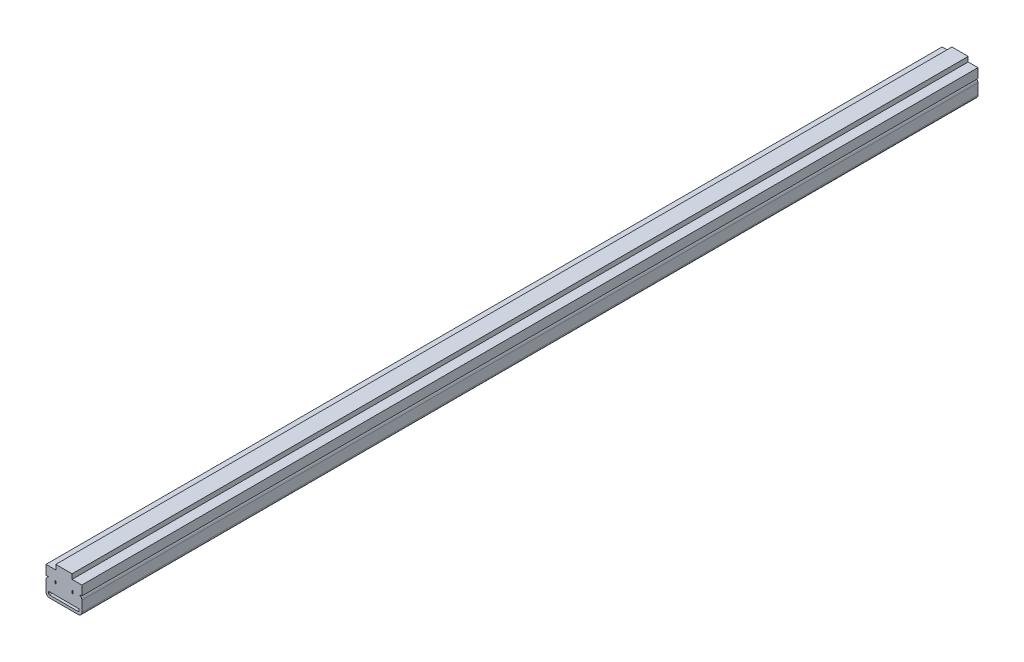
ISO-10303-21;
HEADER;
FILE_DESCRIPTION(('STEP AP214'),'2;1');
FILE_NAME('part.step','',(''),(''),'','','');
FILE_SCHEMA(('AUTOMOTIVE_DESIGN { 1 0 10303 214 1 1 1 1 }'));
ENDSEC;
DATA;
#1=APPLICATION_CONTEXT('core data for automotive mechanical design processes');
#2=APPLICATION_PROTOCOL_DEFINITION('international standard','automotive_design',2000,#1);
#3=PRODUCT_CONTEXT('',#1,'mechanical');
#4=PRODUCT('Part','Part','',(#3));
#5=PRODUCT_RELATED_PRODUCT_CATEGORY('part','',(#4));
#6=PRODUCT_DEFINITION_FORMATION('','',#4);
#7=PRODUCT_DEFINITION_CONTEXT('part definition',#1,'design');
#8=PRODUCT_DEFINITION('design','',#6,#7);
#9=PRODUCT_DEFINITION_SHAPE('','',#8);
#10=(LENGTH_UNIT() NAMED_UNIT(*) SI_UNIT(.MILLI.,.METRE.));
#11=(NAMED_UNIT(*) PLANE_ANGLE_UNIT() SI_UNIT($,.RADIAN.));
#12=(NAMED_UNIT(*) SI_UNIT($,.STERADIAN.) SOLID_ANGLE_UNIT());
#13=UNCERTAINTY_MEASURE_WITH_UNIT(LENGTH_MEASURE(1.E-05),#10,'distance_accuracy_value','');
#14=(GEOMETRIC_REPRESENTATION_CONTEXT(3) GLOBAL_UNCERTAINTY_ASSIGNED_CONTEXT((#13)) GLOBAL_UNIT_ASSIGNED_CONTEXT((#10,
#11,#12)) REPRESENTATION_CONTEXT('',''));
#15=CARTESIAN_POINT('',(0.,0.,0.));
#16=DIRECTION('',(0.,0.,1.));
#17=DIRECTION('',(1.,0.,0.));
#18=AXIS2_PLACEMENT_3D('',#15,#16,#17);
#19=CARTESIAN_POINT('',(8.,7.9999999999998,0.));
#20=DIRECTION('',(0.,0.,1.));
#21=DIRECTION('',(1.,0.,0.));
#22=AXIS2_PLACEMENT_3D('',#19,#20,#21);
#23=PLANE('',#22);
#24=DIRECTION('',(0.,-1.,0.));
#25=VECTOR('',#24,1.);
#26=CARTESIAN_POINT('',(-8.5,3.,0.));
#27=LINE('',#26,#25);
#28=CARTESIAN_POINT('',(-8.5,3.,0.));
#29=VERTEX_POINT('',#28);
#30=CARTESIAN_POINT('',(-8.5,2.,0.));
#31=VERTEX_POINT('',#30);
#32=EDGE_CURVE('E225',#29,#31,#27,.T.);
#33=ORIENTED_EDGE('',*,*,#32,.T.);
#34=CARTESIAN_POINT('',(-8.,2.,0.));
#35=DIRECTION('',(0.,0.,1.));
#36=DIRECTION('',(1.,0.,0.));
#37=AXIS2_PLACEMENT_3D('',#34,#35,#36);
#38=CIRCLE('',#37,0.5);
#39=CARTESIAN_POINT('',(-8.,1.5,0.));
#40=VERTEX_POINT('',#39);
#41=EDGE_CURVE('E220',#31,#40,#38,.T.);
#42=ORIENTED_EDGE('',*,*,#41,.T.);
#43=DIRECTION('',(-1.,0.,0.));
#44=VECTOR('',#43,1.);
#45=CARTESIAN_POINT('',(8.,1.5,0.));
#46=LINE('',#45,#44);
#47=CARTESIAN_POINT('',(8.,1.5,0.));
#48=VERTEX_POINT('',#47);
#49=EDGE_CURVE('E212',#48,#40,#46,.T.);
#50=ORIENTED_EDGE('',*,*,#49,.F.);
#51=CARTESIAN_POINT('',(8.,2.,0.));
#52=DIRECTION('',(0.,0.,1.));
#53=DIRECTION('',(1.,0.,0.));
#54=AXIS2_PLACEMENT_3D('',#51,#52,#53);
#55=CIRCLE('',#54,0.5);
#56=CARTESIAN_POINT('',(8.5,2.,0.));
#57=VERTEX_POINT('',#56);
#58=EDGE_CURVE('E29',#48,#57,#55,.T.);
#59=ORIENTED_EDGE('',*,*,#58,.T.);
#60=DIRECTION('',(0.,-1.,0.));
#61=VECTOR('',#60,1.);
#62=CARTESIAN_POINT('',(8.5,3.,0.));
#63=LINE('',#62,#61);
#64=CARTESIAN_POINT('',(8.5,3.,0.));
#65=VERTEX_POINT('',#64);
#66=EDGE_CURVE('E237',#65,#57,#63,.T.);
#67=ORIENTED_EDGE('',*,*,#66,.F.);
#68=DIRECTION('',(-1.,0.,0.));
#69=VECTOR('',#68,1.);
#70=CARTESIAN_POINT('',(8.5,3.,0.));
#71=LINE('',#70,#69);
#72=EDGE_CURVE('E239',#65,#29,#71,.T.);
#73=ORIENTED_EDGE('',*,*,#72,.T.);
#74=EDGE_LOOP('',(#33,#42,#50,#59,#67,#73));
#75=FACE_BOUND('',#74,.T.);
#76=DIRECTION('',(0.,-1.,0.));
#77=VECTOR('',#76,1.);
#78=CARTESIAN_POINT('',(4.55,18.,0.));
#79=LINE('',#78,#77);
#80=CARTESIAN_POINT('',(4.55,18.,0.));
#81=VERTEX_POINT('',#80);
#82=CARTESIAN_POINT('',(4.55,15.3,0.));
#83=VERTEX_POINT('',#82);
#84=EDGE_CURVE('E326',#81,#83,#79,.T.);
#85=ORIENTED_EDGE('',*,*,#84,.T.);
#86=DIRECTION('',(1.,0.,0.));
#87=VECTOR('',#86,1.);
#88=CARTESIAN_POINT('',(4.55,15.3,0.));
#89=LINE('',#88,#87);
#90=CARTESIAN_POINT('',(10.,15.3,0.));
#91=VERTEX_POINT('',#90);
#92=EDGE_CURVE('E329',#83,#91,#89,.T.);
#93=ORIENTED_EDGE('',*,*,#92,.T.);
#94=DIRECTION('',(0.,-1.,0.));
#95=VECTOR('',#94,1.);
#96=CARTESIAN_POINT('',(10.,15.3,0.));
#97=LINE('',#96,#95);
#98=CARTESIAN_POINT('',(10.,9.9999999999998,0.));
#99=VERTEX_POINT('',#98);
#100=EDGE_CURVE('E332',#91,#99,#97,.T.);
#101=ORIENTED_EDGE('',*,*,#100,.T.);
#102=DIRECTION('',(-1.,0.,0.));
#103=VECTOR('',#102,1.);
#104=CARTESIAN_POINT('',(10.,9.9999999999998,0.));
#105=LINE('',#104,#103);
#106=CARTESIAN_POINT('',(8.,9.9999999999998,0.));
#107=VERTEX_POINT('',#106);
#108=EDGE_CURVE('E334',#99,#107,#105,.T.);
#109=ORIENTED_EDGE('',*,*,#108,.T.);
#110=CARTESIAN_POINT('',(8.,7.9999999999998,0.));
#111=DIRECTION('',(0.,0.,1.));
#112=DIRECTION('',(1.,0.,0.));
#113=AXIS2_PLACEMENT_3D('',#110,#111,#112);
#114=CIRCLE('',#113,2.);
#115=CARTESIAN_POINT('',(10.,7.9999999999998,0.));
#116=VERTEX_POINT('',#115);
#117=EDGE_CURVE('E336',#116,#107,#114,.T.);
#118=ORIENTED_EDGE('',*,*,#117,.F.);
#119=DIRECTION('',(0.,-1.,0.));
#120=VECTOR('',#119,1.);
#121=CARTESIAN_POINT('',(10.,7.9999999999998,0.));
#122=LINE('',#121,#120);
#123=CARTESIAN_POINT('',(10.,2.,0.));
#124=VERTEX_POINT('',#123);
#125=EDGE_CURVE('E339',#116,#124,#122,.T.);
#126=ORIENTED_EDGE('',*,*,#125,.T.);
#127=CARTESIAN_POINT('',(8.,2.,0.));
#128=DIRECTION('',(0.,0.,1.));
#129=DIRECTION('',(1.,0.,0.));
#130=AXIS2_PLACEMENT_3D('',#127,#128,#129);
#131=CIRCLE('',#130,2.);
#132=CARTESIAN_POINT('',(8.,0.,0.));
#133=VERTEX_POINT('',#132);
#134=EDGE_CURVE('E341',#133,#124,#131,.T.);
#135=ORIENTED_EDGE('',*,*,#134,.F.);
#136=DIRECTION('',(-1.,0.,0.));
#137=VECTOR('',#136,1.);
#138=CARTESIAN_POINT('',(8.,0.,0.));
#139=LINE('',#138,#137);
#140=CARTESIAN_POINT('',(-8.,0.,0.));
#141=VERTEX_POINT('',#140);
#142=EDGE_CURVE('E344',#133,#141,#139,.T.);
#143=ORIENTED_EDGE('',*,*,#142,.T.);
#144=CARTESIAN_POINT('',(-8.,2.,0.));
#145=DIRECTION('',(0.,0.,1.));
#146=DIRECTION('',(1.,0.,0.));
#147=AXIS2_PLACEMENT_3D('',#144,#145,#146);
#148=CIRCLE('',#147,1.99999999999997);
#149=CARTESIAN_POINT('',(-10.,1.99999999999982,0.));
#150=VERTEX_POINT('',#149);
#151=EDGE_CURVE('E346',#150,#141,#148,.T.);
#152=ORIENTED_EDGE('',*,*,#151,.F.);
#153=DIRECTION('',(0.,-1.,0.));
#154=VECTOR('',#153,1.);
#155=CARTESIAN_POINT('',(-10.,7.9999999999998,0.));
#156=LINE('',#155,#154);
#157=CARTESIAN_POINT('',(-10.,7.9999999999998,0.));
#158=VERTEX_POINT('',#157);
#159=EDGE_CURVE('E349',#158,#150,#156,.T.);
#160=ORIENTED_EDGE('',*,*,#159,.F.);
#161=CARTESIAN_POINT('',(-8.,7.9999999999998,0.));
#162=DIRECTION('',(0.,0.,1.));
#163=DIRECTION('',(1.,0.,0.));
#164=AXIS2_PLACEMENT_3D('',#161,#162,#163);
#165=CIRCLE('',#164,1.99999999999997);
#166=CARTESIAN_POINT('',(-8.,9.9999999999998,0.));
#167=VERTEX_POINT('',#166);
#168=EDGE_CURVE('E352',#167,#158,#165,.T.);
#169=ORIENTED_EDGE('',*,*,#168,.F.);
#170=DIRECTION('',(-1.,0.,0.));
#171=VECTOR('',#170,1.);
#172=CARTESIAN_POINT('',(-8.,9.9999999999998,0.));
#173=LINE('',#172,#171);
#174=CARTESIAN_POINT('',(-10.,9.9999999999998,0.));
#175=VERTEX_POINT('',#174);
#176=EDGE_CURVE('E355',#167,#175,#173,.T.);
#177=ORIENTED_EDGE('',*,*,#176,.T.);
#178=DIRECTION('',(0.,-1.,0.));
#179=VECTOR('',#178,1.);
#180=CARTESIAN_POINT('',(-10.,15.3,0.));
#181=LINE('',#180,#179);
#182=CARTESIAN_POINT('',(-10.,15.3,0.));
#183=VERTEX_POINT('',#182);
#184=EDGE_CURVE('E357',#183,#175,#181,.T.);
#185=ORIENTED_EDGE('',*,*,#184,.F.);
#186=DIRECTION('',(-1.,0.,0.));
#187=VECTOR('',#186,1.);
#188=CARTESIAN_POINT('',(-4.55,15.3,0.));
#189=LINE('',#188,#187);
#190=CARTESIAN_POINT('',(-4.55,15.3,0.));
#191=VERTEX_POINT('',#190);
#192=EDGE_CURVE('E360',#191,#183,#189,.T.);
#193=ORIENTED_EDGE('',*,*,#192,.F.);
#194=DIRECTION('',(0.,-1.,0.));
#195=VECTOR('',#194,1.);
#196=CARTESIAN_POINT('',(-4.55,18.,0.));
#197=LINE('',#196,#195);
#198=CARTESIAN_POINT('',(-4.55,18.,0.));
#199=VERTEX_POINT('',#198);
#200=EDGE_CURVE('E363',#199,#191,#197,.T.);
#201=ORIENTED_EDGE('',*,*,#200,.F.);
#202=DIRECTION('',(-1.,0.,0.));
#203=VECTOR('',#202,1.);
#204=CARTESIAN_POINT('',(4.55,18.,0.));
#205=LINE('',#204,#203);
#206=EDGE_CURVE('E366',#81,#199,#205,.T.);
#207=ORIENTED_EDGE('',*,*,#206,.F.);
#208=EDGE_LOOP('',(#85,#93,#101,#109,#118,#126,#135,#143,#152,#160,#169,#177,#185,#193,#201,#207));
#209=FACE_BOUND('',#208,.T.);
#210=DIRECTION('',(-1.,1.11022302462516E-13,0.));
#211=VECTOR('',#210,1.);
#212=CARTESIAN_POINT('',(-4.5,8.4999999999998,0.));
#213=LINE('',#212,#211);
#214=CARTESIAN_POINT('',(-4.5,8.4999999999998,0.));
#215=VERTEX_POINT('',#214);
#216=CARTESIAN_POINT('',(-5.,8.5,0.));
#217=VERTEX_POINT('',#216);
#218=EDGE_CURVE('E305',#215,#217,#213,.T.);
#219=ORIENTED_EDGE('',*,*,#218,.F.);
#220=DIRECTION('',(0.,1.,0.));
#221=VECTOR('',#220,1.);
#222=CARTESIAN_POINT('',(-4.5,8.4999999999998,0.));
#223=LINE('',#222,#221);
#224=CARTESIAN_POINT('',(-4.5,10.,0.));
#225=VERTEX_POINT('',#224);
#226=EDGE_CURVE('E295',#215,#225,#223,.T.);
#227=ORIENTED_EDGE('',*,*,#226,.T.);
#228=DIRECTION('',(-1.,-1.11022302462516E-13,0.));
#229=VECTOR('',#228,1.);
#230=CARTESIAN_POINT('',(-4.5,10.,0.));
#231=LINE('',#230,#229);
#232=CARTESIAN_POINT('',(-5.,9.9999999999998,0.));
#233=VERTEX_POINT('',#232);
#234=EDGE_CURVE('E298',#225,#233,#231,.T.);
#235=ORIENTED_EDGE('',*,*,#234,.T.);
#236=DIRECTION('',(0.,1.,0.));
#237=VECTOR('',#236,1.);
#238=CARTESIAN_POINT('',(-5.,8.5,0.));
#239=LINE('',#238,#237);
#240=EDGE_CURVE('E302',#217,#233,#239,.T.);
#241=ORIENTED_EDGE('',*,*,#240,.F.);
#242=EDGE_LOOP('',(#219,#227,#235,#241));
#243=FACE_BOUND('',#242,.T.);
#244=DIRECTION('',(-1.,0.,0.));
#245=VECTOR('',#244,1.);
#246=CARTESIAN_POINT('',(5.,8.5,0.));
#247=LINE('',#246,#245);
#248=CARTESIAN_POINT('',(5.,8.5,0.));
#249=VERTEX_POINT('',#248);
#250=CARTESIAN_POINT('',(4.5,8.5,0.));
#251=VERTEX_POINT('',#250);
#252=EDGE_CURVE('E263',#249,#251,#247,.T.);
#253=ORIENTED_EDGE('',*,*,#252,.F.);
#254=DIRECTION('',(0.,1.,0.));
#255=VECTOR('',#254,1.);
#256=CARTESIAN_POINT('',(5.,8.5,0.));
#257=LINE('',#256,#255);
#258=CARTESIAN_POINT('',(5.,9.9999999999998,0.));
#259=VERTEX_POINT('',#258);
#260=EDGE_CURVE('E271',#249,#259,#257,.T.);
#261=ORIENTED_EDGE('',*,*,#260,.T.);
#262=DIRECTION('',(-1.,1.11022302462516E-13,0.));
#263=VECTOR('',#262,1.);
#264=CARTESIAN_POINT('',(5.,9.9999999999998,0.));
#265=LINE('',#264,#263);
#266=CARTESIAN_POINT('',(4.5,10.,0.));
#267=VERTEX_POINT('',#266);
#268=EDGE_CURVE('E268',#259,#267,#265,.T.);
#269=ORIENTED_EDGE('',*,*,#268,.T.);
#270=DIRECTION('',(0.,1.,0.));
#271=VECTOR('',#270,1.);
#272=CARTESIAN_POINT('',(4.5,8.5,0.));
#273=LINE('',#272,#271);
#274=EDGE_CURVE('E265',#251,#267,#273,.T.);
#275=ORIENTED_EDGE('',*,*,#274,.F.);
#276=EDGE_LOOP('',(#253,#261,#269,#275));
#277=FACE_BOUND('',#276,.T.);
#278=ADVANCED_FACE('F14',(#75,#209,#243,#277),#23,.F.);
#279=CARTESIAN_POINT('',(8.,7.9999999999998,500.));
#280=DIRECTION('',(0.,0.,1.));
#281=DIRECTION('',(1.,0.,0.));
#282=AXIS2_PLACEMENT_3D('',#279,#280,#281);
#283=PLANE('',#282);
#284=CARTESIAN_POINT('',(-8.,2.,500.));
#285=DIRECTION('',(0.,0.,1.));
#286=DIRECTION('',(1.,0.,0.));
#287=AXIS2_PLACEMENT_3D('',#284,#285,#286);
#288=CIRCLE('',#287,0.5);
#289=CARTESIAN_POINT('',(-8.5,2.,500.));
#290=VERTEX_POINT('',#289);
#291=CARTESIAN_POINT('',(-8.,1.5,500.));
#292=VERTEX_POINT('',#291);
#293=EDGE_CURVE('E37',#290,#292,#288,.T.);
#294=ORIENTED_EDGE('',*,*,#293,.F.);
#295=DIRECTION('',(0.,-1.,0.));
#296=VECTOR('',#295,1.);
#297=CARTESIAN_POINT('',(-8.5,3.,500.));
#298=LINE('',#297,#296);
#299=CARTESIAN_POINT('',(-8.5,3.,500.));
#300=VERTEX_POINT('',#299);
#301=EDGE_CURVE('E230',#300,#290,#298,.T.);
#302=ORIENTED_EDGE('',*,*,#301,.F.);
#303=DIRECTION('',(-1.,0.,0.));
#304=VECTOR('',#303,1.);
#305=CARTESIAN_POINT('',(8.5,3.,500.));
#306=LINE('',#305,#304);
#307=CARTESIAN_POINT('',(8.5,3.,500.));
#308=VERTEX_POINT('',#307);
#309=EDGE_CURVE('E233',#308,#300,#306,.T.);
#310=ORIENTED_EDGE('',*,*,#309,.F.);
#311=DIRECTION('',(0.,-1.,0.));
#312=VECTOR('',#311,1.);
#313=CARTESIAN_POINT('',(8.5,3.,500.));
#314=LINE('',#313,#312);
#315=CARTESIAN_POINT('',(8.5,2.,500.));
#316=VERTEX_POINT('',#315);
#317=EDGE_CURVE('E248',#308,#316,#314,.T.);
#318=ORIENTED_EDGE('',*,*,#317,.T.);
#319=CARTESIAN_POINT('',(8.,2.,500.));
#320=DIRECTION('',(0.,0.,1.));
#321=DIRECTION('',(1.,0.,0.));
#322=AXIS2_PLACEMENT_3D('',#319,#320,#321);
#323=CIRCLE('',#322,0.5);
#324=CARTESIAN_POINT('',(8.,1.5,500.));
#325=VERTEX_POINT('',#324);
#326=EDGE_CURVE('E245',#325,#316,#323,.T.);
#327=ORIENTED_EDGE('',*,*,#326,.F.);
#328=DIRECTION('',(-1.,0.,0.));
#329=VECTOR('',#328,1.);
#330=CARTESIAN_POINT('',(8.,1.5,500.));
#331=LINE('',#330,#329);
#332=EDGE_CURVE('E243',#325,#292,#331,.T.);
#333=ORIENTED_EDGE('',*,*,#332,.T.);
#334=EDGE_LOOP('',(#294,#302,#310,#318,#327,#333));
#335=FACE_BOUND('',#334,.T.);
#336=DIRECTION('',(0.,-1.,0.));
#337=VECTOR('',#336,1.);
#338=CARTESIAN_POINT('',(4.55,18.,500.));
#339=LINE('',#338,#337);
#340=CARTESIAN_POINT('',(4.55,18.,500.));
#341=VERTEX_POINT('',#340);
#342=CARTESIAN_POINT('',(4.55,15.3,500.));
#343=VERTEX_POINT('',#342);
#344=EDGE_CURVE('E319',#341,#343,#339,.T.);
#345=ORIENTED_EDGE('',*,*,#344,.F.);
#346=DIRECTION('',(-1.,0.,0.));
#347=VECTOR('',#346,1.);
#348=CARTESIAN_POINT('',(4.55,18.,500.));
#349=LINE('',#348,#347);
#350=CARTESIAN_POINT('',(-4.55,18.,500.));
#351=VERTEX_POINT('',#350);
#352=EDGE_CURVE('E330',#341,#351,#349,.T.);
#353=ORIENTED_EDGE('',*,*,#352,.T.);
#354=DIRECTION('',(0.,-1.,0.));
#355=VECTOR('',#354,1.);
#356=CARTESIAN_POINT('',(-4.55,18.,500.));
#357=LINE('',#356,#355);
#358=CARTESIAN_POINT('',(-4.55,15.3,500.));
#359=VERTEX_POINT('',#358);
#360=EDGE_CURVE('E409',#351,#359,#357,.T.);
#361=ORIENTED_EDGE('',*,*,#360,.T.);
#362=DIRECTION('',(-1.,0.,0.));
#363=VECTOR('',#362,1.);
#364=CARTESIAN_POINT('',(-4.55,15.3,500.));
#365=LINE('',#364,#363);
#366=CARTESIAN_POINT('',(-10.,15.3,500.));
#367=VERTEX_POINT('',#366);
#368=EDGE_CURVE('E406',#359,#367,#365,.T.);
#369=ORIENTED_EDGE('',*,*,#368,.T.);
#370=DIRECTION('',(0.,-1.,0.));
#371=VECTOR('',#370,1.);
#372=CARTESIAN_POINT('',(-10.,15.3,500.));
#373=LINE('',#372,#371);
#374=CARTESIAN_POINT('',(-10.,9.9999999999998,500.));
#375=VERTEX_POINT('',#374);
#376=EDGE_CURVE('E403',#367,#375,#373,.T.);
#377=ORIENTED_EDGE('',*,*,#376,.T.);
#378=DIRECTION('',(-1.,0.,0.));
#379=VECTOR('',#378,1.);
#380=CARTESIAN_POINT('',(-8.,9.9999999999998,500.));
#381=LINE('',#380,#379);
#382=CARTESIAN_POINT('',(-8.,9.9999999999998,500.));
#383=VERTEX_POINT('',#382);
#384=EDGE_CURVE('E400',#383,#375,#381,.T.);
#385=ORIENTED_EDGE('',*,*,#384,.F.);
#386=CARTESIAN_POINT('',(-8.,7.9999999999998,500.));
#387=DIRECTION('',(0.,0.,1.));
#388=DIRECTION('',(1.,0.,0.));
#389=AXIS2_PLACEMENT_3D('',#386,#387,#388);
#390=CIRCLE('',#389,1.99999999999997);
#391=CARTESIAN_POINT('',(-10.,7.9999999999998,500.));
#392=VERTEX_POINT('',#391);
#393=EDGE_CURVE('E397',#383,#392,#390,.T.);
#394=ORIENTED_EDGE('',*,*,#393,.T.);
#395=DIRECTION('',(0.,-1.,0.));
#396=VECTOR('',#395,1.);
#397=CARTESIAN_POINT('',(-10.,7.9999999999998,500.));
#398=LINE('',#397,#396);
#399=CARTESIAN_POINT('',(-10.,1.99999999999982,500.));
#400=VERTEX_POINT('',#399);
#401=EDGE_CURVE('E394',#392,#400,#398,.T.);
#402=ORIENTED_EDGE('',*,*,#401,.T.);
#403=CARTESIAN_POINT('',(-8.,2.,500.));
#404=DIRECTION('',(0.,0.,1.));
#405=DIRECTION('',(1.,0.,0.));
#406=AXIS2_PLACEMENT_3D('',#403,#404,#405);
#407=CIRCLE('',#406,1.99999999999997);
#408=CARTESIAN_POINT('',(-8.,0.,500.));
#409=VERTEX_POINT('',#408);
#410=EDGE_CURVE('E391',#400,#409,#407,.T.);
#411=ORIENTED_EDGE('',*,*,#410,.T.);
#412=DIRECTION('',(-1.,0.,0.));
#413=VECTOR('',#412,1.);
#414=CARTESIAN_POINT('',(8.,0.,500.));
#415=LINE('',#414,#413);
#416=CARTESIAN_POINT('',(8.,0.,500.));
#417=VERTEX_POINT('',#416);
#418=EDGE_CURVE('E388',#417,#409,#415,.T.);
#419=ORIENTED_EDGE('',*,*,#418,.F.);
#420=CARTESIAN_POINT('',(8.,2.,500.));
#421=DIRECTION('',(0.,0.,1.));
#422=DIRECTION('',(1.,0.,0.));
#423=AXIS2_PLACEMENT_3D('',#420,#421,#422);
#424=CIRCLE('',#423,2.);
#425=CARTESIAN_POINT('',(10.,2.,500.));
#426=VERTEX_POINT('',#425);
#427=EDGE_CURVE('E385',#417,#426,#424,.T.);
#428=ORIENTED_EDGE('',*,*,#427,.T.);
#429=DIRECTION('',(0.,-1.,0.));
#430=VECTOR('',#429,1.);
#431=CARTESIAN_POINT('',(10.,7.9999999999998,500.));
#432=LINE('',#431,#430);
#433=CARTESIAN_POINT('',(10.,7.9999999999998,500.));
#434=VERTEX_POINT('',#433);
#435=EDGE_CURVE('E382',#434,#426,#432,.T.);
#436=ORIENTED_EDGE('',*,*,#435,.F.);
#437=CARTESIAN_POINT('',(8.,7.9999999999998,500.));
#438=DIRECTION('',(0.,0.,1.));
#439=DIRECTION('',(1.,0.,0.));
#440=AXIS2_PLACEMENT_3D('',#437,#438,#439);
#441=CIRCLE('',#440,2.);
#442=CARTESIAN_POINT('',(8.,9.9999999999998,500.));
#443=VERTEX_POINT('',#442);
#444=EDGE_CURVE('E379',#434,#443,#441,.T.);
#445=ORIENTED_EDGE('',*,*,#444,.T.);
#446=DIRECTION('',(-1.,0.,0.));
#447=VECTOR('',#446,1.);
#448=CARTESIAN_POINT('',(10.,9.9999999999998,500.));
#449=LINE('',#448,#447);
#450=CARTESIAN_POINT('',(10.,9.9999999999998,500.));
#451=VERTEX_POINT('',#450);
#452=EDGE_CURVE('E376',#451,#443,#449,.T.);
#453=ORIENTED_EDGE('',*,*,#452,.F.);
#454=DIRECTION('',(0.,-1.,0.));
#455=VECTOR('',#454,1.);
#456=CARTESIAN_POINT('',(10.,15.3,500.));
#457=LINE('',#456,#455);
#458=CARTESIAN_POINT('',(10.,15.3,500.));
#459=VERTEX_POINT('',#458);
#460=EDGE_CURVE('E374',#459,#451,#457,.T.);
#461=ORIENTED_EDGE('',*,*,#460,.F.);
#462=DIRECTION('',(1.,0.,0.));
#463=VECTOR('',#462,1.);
#464=CARTESIAN_POINT('',(4.55,15.3,500.));
#465=LINE('',#464,#463);
#466=EDGE_CURVE('E372',#343,#459,#465,.T.);
#467=ORIENTED_EDGE('',*,*,#466,.F.);
#468=EDGE_LOOP('',(#345,#353,#361,#369,#377,#385,#394,#402,#411,#419,#428,#436,#445,#453,#461,#467));
#469=FACE_BOUND('',#468,.T.);
#470=DIRECTION('',(0.,1.,0.));
#471=VECTOR('',#470,1.);
#472=CARTESIAN_POINT('',(-4.5,8.4999999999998,500.));
#473=LINE('',#472,#471);
#474=CARTESIAN_POINT('',(-4.5,8.4999999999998,500.));
#475=VERTEX_POINT('',#474);
#476=CARTESIAN_POINT('',(-4.5,10.,500.));
#477=VERTEX_POINT('',#476);
#478=EDGE_CURVE('E294',#475,#477,#473,.T.);
#479=ORIENTED_EDGE('',*,*,#478,.F.);
#480=DIRECTION('',(-1.,1.11022302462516E-13,0.));
#481=VECTOR('',#480,1.);
#482=CARTESIAN_POINT('',(-4.5,8.4999999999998,500.));
#483=LINE('',#482,#481);
#484=CARTESIAN_POINT('',(-5.,8.5,500.));
#485=VERTEX_POINT('',#484);
#486=EDGE_CURVE('E299',#475,#485,#483,.T.);
#487=ORIENTED_EDGE('',*,*,#486,.T.);
#488=DIRECTION('',(0.,1.,0.));
#489=VECTOR('',#488,1.);
#490=CARTESIAN_POINT('',(-5.,8.5,500.));
#491=LINE('',#490,#489);
#492=CARTESIAN_POINT('',(-5.,9.9999999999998,500.));
#493=VERTEX_POINT('',#492);
#494=EDGE_CURVE('E312',#485,#493,#491,.T.);
#495=ORIENTED_EDGE('',*,*,#494,.T.);
#496=DIRECTION('',(-1.,-1.11022302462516E-13,0.));
#497=VECTOR('',#496,1.);
#498=CARTESIAN_POINT('',(-4.5,10.,500.));
#499=LINE('',#498,#497);
#500=EDGE_CURVE('E309',#477,#493,#499,.T.);
#501=ORIENTED_EDGE('',*,*,#500,.F.);
#502=EDGE_LOOP('',(#479,#487,#495,#501));
#503=FACE_BOUND('',#502,.T.);
#504=DIRECTION('',(0.,1.,0.));
#505=VECTOR('',#504,1.);
#506=CARTESIAN_POINT('',(5.,8.5,500.));
#507=LINE('',#506,#505);
#508=CARTESIAN_POINT('',(5.,8.5,500.));
#509=VERTEX_POINT('',#508);
#510=CARTESIAN_POINT('',(5.,9.9999999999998,500.));
#511=VERTEX_POINT('',#510);
#512=EDGE_CURVE('E266',#509,#511,#507,.T.);
#513=ORIENTED_EDGE('',*,*,#512,.F.);
#514=DIRECTION('',(-1.,0.,0.));
#515=VECTOR('',#514,1.);
#516=CARTESIAN_POINT('',(5.,8.5,500.));
#517=LINE('',#516,#515);
#518=CARTESIAN_POINT('',(4.5,8.5,500.));
#519=VERTEX_POINT('',#518);
#520=EDGE_CURVE('E255',#509,#519,#517,.T.);
#521=ORIENTED_EDGE('',*,*,#520,.T.);
#522=DIRECTION('',(0.,1.,0.));
#523=VECTOR('',#522,1.);
#524=CARTESIAN_POINT('',(4.5,8.5,500.));
#525=LINE('',#524,#523);
#526=CARTESIAN_POINT('',(4.5,10.,500.));
#527=VERTEX_POINT('',#526);
#528=EDGE_CURVE('E277',#519,#527,#525,.T.);
#529=ORIENTED_EDGE('',*,*,#528,.T.);
#530=DIRECTION('',(-1.,1.11022302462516E-13,0.));
#531=VECTOR('',#530,1.);
#532=CARTESIAN_POINT('',(5.,9.9999999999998,500.));
#533=LINE('',#532,#531);
#534=EDGE_CURVE('E280',#511,#527,#533,.T.);
#535=ORIENTED_EDGE('',*,*,#534,.F.);
#536=EDGE_LOOP('',(#513,#521,#529,#535));
#537=FACE_BOUND('',#536,.T.);
#538=ADVANCED_FACE('F452',(#335,#469,#503,#537),#283,.T.);
#539=CARTESIAN_POINT('',(4.55,18.,0.));
#540=DIRECTION('',(-1.,0.,0.));
#541=DIRECTION('',(0.,0.,1.));
#542=AXIS2_PLACEMENT_3D('',#539,#540,#541);
#543=PLANE('',#542);
#544=ORIENTED_EDGE('',*,*,#344,.T.);
#545=DIRECTION('',(0.,0.,1.));
#546=VECTOR('',#545,1.);
#547=CARTESIAN_POINT('',(4.55,15.3,0.));
#548=LINE('',#547,#546);
#549=EDGE_CURVE('E9',#83,#343,#548,.T.);
#550=ORIENTED_EDGE('',*,*,#549,.F.);
#551=ORIENTED_EDGE('',*,*,#84,.F.);
#552=DIRECTION('',(0.,0.,1.));
#553=VECTOR('',#552,1.);
#554=CARTESIAN_POINT('',(4.55,18.,0.));
#555=LINE('',#554,#553);
#556=EDGE_CURVE('E369',#81,#341,#555,.T.);
#557=ORIENTED_EDGE('',*,*,#556,.T.);
#558=EDGE_LOOP('',(#544,#550,#551,#557));
#559=FACE_BOUND('',#558,.T.);
#560=ADVANCED_FACE('F16',(#559),#543,.F.);
#561=CARTESIAN_POINT('',(4.55,15.3,0.));
#562=DIRECTION('',(0.,-1.,0.));
#563=DIRECTION('',(0.,0.,-1.));
#564=AXIS2_PLACEMENT_3D('',#561,#562,#563);
#565=PLANE('',#564);
#566=ORIENTED_EDGE('',*,*,#466,.T.);
#567=DIRECTION('',(0.,0.,1.));
#568=VECTOR('',#567,1.);
#569=CARTESIAN_POINT('',(10.,15.3,0.));
#570=LINE('',#569,#568);
#571=EDGE_CURVE('E22',#91,#459,#570,.T.);
#572=ORIENTED_EDGE('',*,*,#571,.F.);
#573=ORIENTED_EDGE('',*,*,#92,.F.);
#574=ORIENTED_EDGE('',*,*,#549,.T.);
#575=EDGE_LOOP('',(#566,#572,#573,#574));
#576=FACE_BOUND('',#575,.T.);
#577=ADVANCED_FACE('F465',(#576),#565,.F.);
#578=CARTESIAN_POINT('',(10.,15.3,0.));
#579=DIRECTION('',(-1.,0.,0.));
#580=DIRECTION('',(0.,-1.,0.));
#581=AXIS2_PLACEMENT_3D('',#578,#579,#580);
#582=PLANE('',#581);
#583=ORIENTED_EDGE('',*,*,#460,.T.);
#584=DIRECTION('',(0.,0.,1.));
#585=VECTOR('',#584,1.);
#586=CARTESIAN_POINT('',(10.,9.9999999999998,0.));
#587=LINE('',#586,#585);
#588=EDGE_CURVE('E439',#99,#451,#587,.T.);
#589=ORIENTED_EDGE('',*,*,#588,.F.);
#590=ORIENTED_EDGE('',*,*,#100,.F.);
#591=ORIENTED_EDGE('',*,*,#571,.T.);
#592=EDGE_LOOP('',(#583,#589,#590,#591));
#593=FACE_BOUND('',#592,.T.);
#594=ADVANCED_FACE('F446',(#593),#582,.F.);
#595=CARTESIAN_POINT('',(10.,9.9999999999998,0.));
#596=DIRECTION('',(0.,1.,0.));
#597=DIRECTION('',(0.,0.,1.));
#598=AXIS2_PLACEMENT_3D('',#595,#596,#597);
#599=PLANE('',#598);
#600=ORIENTED_EDGE('',*,*,#452,.T.);
#601=DIRECTION('',(0.,0.,1.));
#602=VECTOR('',#601,1.);
#603=CARTESIAN_POINT('',(8.,9.9999999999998,0.));
#604=LINE('',#603,#602);
#605=EDGE_CURVE('E437',#107,#443,#604,.T.);
#606=ORIENTED_EDGE('',*,*,#605,.F.);
#607=ORIENTED_EDGE('',*,*,#108,.F.);
#608=ORIENTED_EDGE('',*,*,#588,.T.);
#609=EDGE_LOOP('',(#600,#606,#607,#608));
#610=FACE_BOUND('',#609,.T.);
#611=ADVANCED_FACE('F458',(#610),#599,.F.);
#612=CARTESIAN_POINT('',(8.,7.9999999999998,0.));
#613=DIRECTION('',(0.,0.,1.));
#614=DIRECTION('',(1.,0.,0.));
#615=AXIS2_PLACEMENT_3D('',#612,#613,#614);
#616=CYLINDRICAL_SURFACE('',#615,2.);
#617=ORIENTED_EDGE('',*,*,#444,.F.);
#618=DIRECTION('',(0.,0.,1.));
#619=VECTOR('',#618,1.);
#620=CARTESIAN_POINT('',(10.,7.9999999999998,0.));
#621=LINE('',#620,#619);
#622=EDGE_CURVE('E435',#116,#434,#621,.T.);
#623=ORIENTED_EDGE('',*,*,#622,.F.);
#624=ORIENTED_EDGE('',*,*,#117,.T.);
#625=ORIENTED_EDGE('',*,*,#605,.T.);
#626=EDGE_LOOP('',(#617,#623,#624,#625));
#627=FACE_BOUND('',#626,.T.);
#628=ADVANCED_FACE('F511',(#627),#616,.T.);
#629=CARTESIAN_POINT('',(10.,7.9999999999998,0.));
#630=DIRECTION('',(-1.,0.,0.));
#631=DIRECTION('',(0.,0.,1.));
#632=AXIS2_PLACEMENT_3D('',#629,#630,#631);
#633=PLANE('',#632);
#634=ORIENTED_EDGE('',*,*,#435,.T.);
#635=DIRECTION('',(0.,0.,1.));
#636=VECTOR('',#635,1.);
#637=CARTESIAN_POINT('',(10.,2.,0.));
#638=LINE('',#637,#636);
#639=EDGE_CURVE('E433',#124,#426,#638,.T.);
#640=ORIENTED_EDGE('',*,*,#639,.F.);
#641=ORIENTED_EDGE('',*,*,#125,.F.);
#642=ORIENTED_EDGE('',*,*,#622,.T.);
#643=EDGE_LOOP('',(#634,#640,#641,#642));
#644=FACE_BOUND('',#643,.T.);
#645=ADVANCED_FACE('F513',(#644),#633,.F.);
#646=CARTESIAN_POINT('',(8.,2.,0.));
#647=DIRECTION('',(0.,0.,1.));
#648=DIRECTION('',(1.,0.,0.));
#649=AXIS2_PLACEMENT_3D('',#646,#647,#648);
#650=CYLINDRICAL_SURFACE('',#649,2.);
#651=ORIENTED_EDGE('',*,*,#427,.F.);
#652=DIRECTION('',(0.,0.,1.));
#653=VECTOR('',#652,1.);
#654=CARTESIAN_POINT('',(8.,0.,0.));
#655=LINE('',#654,#653);
#656=EDGE_CURVE('E431',#133,#417,#655,.T.);
#657=ORIENTED_EDGE('',*,*,#656,.F.);
#658=ORIENTED_EDGE('',*,*,#134,.T.);
#659=ORIENTED_EDGE('',*,*,#639,.T.);
#660=EDGE_LOOP('',(#651,#657,#658,#659));
#661=FACE_BOUND('',#660,.T.);
#662=ADVANCED_FACE('F507',(#661),#650,.T.);
#663=CARTESIAN_POINT('',(8.,0.,0.));
#664=DIRECTION('',(0.,1.,0.));
#665=DIRECTION('',(-1.,0.,0.));
#666=AXIS2_PLACEMENT_3D('',#663,#664,#665);
#667=PLANE('',#666);
#668=ORIENTED_EDGE('',*,*,#418,.T.);
#669=DIRECTION('',(0.,0.,1.));
#670=VECTOR('',#669,1.);
#671=CARTESIAN_POINT('',(-8.,0.,0.));
#672=LINE('',#671,#670);
#673=EDGE_CURVE('E429',#141,#409,#672,.T.);
#674=ORIENTED_EDGE('',*,*,#673,.F.);
#675=ORIENTED_EDGE('',*,*,#142,.F.);
#676=ORIENTED_EDGE('',*,*,#656,.T.);
#677=EDGE_LOOP('',(#668,#674,#675,#676));
#678=FACE_BOUND('',#677,.T.);
#679=ADVANCED_FACE('F504',(#678),#667,.F.);
#680=CARTESIAN_POINT('',(-8.,2.,0.));
#681=DIRECTION('',(0.,0.,1.));
#682=DIRECTION('',(1.,0.,0.));
#683=AXIS2_PLACEMENT_3D('',#680,#681,#682);
#684=CYLINDRICAL_SURFACE('',#683,1.99999999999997);
#685=ORIENTED_EDGE('',*,*,#410,.F.);
#686=DIRECTION('',(0.,0.,1.));
#687=VECTOR('',#686,1.);
#688=CARTESIAN_POINT('',(-10.,1.99999999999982,0.));
#689=LINE('',#688,#687);
#690=EDGE_CURVE('E427',#150,#400,#689,.T.);
#691=ORIENTED_EDGE('',*,*,#690,.F.);
#692=ORIENTED_EDGE('',*,*,#151,.T.);
#693=ORIENTED_EDGE('',*,*,#673,.T.);
#694=EDGE_LOOP('',(#685,#691,#692,#693));
#695=FACE_BOUND('',#694,.T.);
#696=ADVANCED_FACE('F499',(#695),#684,.T.);
#697=CARTESIAN_POINT('',(-10.,7.9999999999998,0.));
#698=DIRECTION('',(-1.,0.,0.));
#699=DIRECTION('',(0.,0.,1.));
#700=AXIS2_PLACEMENT_3D('',#697,#698,#699);
#701=PLANE('',#700);
#702=ORIENTED_EDGE('',*,*,#401,.F.);
#703=DIRECTION('',(0.,0.,1.));
#704=VECTOR('',#703,1.);
#705=CARTESIAN_POINT('',(-10.,7.9999999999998,0.));
#706=LINE('',#705,#704);
#707=EDGE_CURVE('E425',#158,#392,#706,.T.);
#708=ORIENTED_EDGE('',*,*,#707,.F.);
#709=ORIENTED_EDGE('',*,*,#159,.T.);
#710=ORIENTED_EDGE('',*,*,#690,.T.);
#711=EDGE_LOOP('',(#702,#708,#709,#710));
#712=FACE_BOUND('',#711,.T.);
#713=ADVANCED_FACE('F494',(#712),#701,.T.);
#714=CARTESIAN_POINT('',(-8.,7.9999999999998,0.));
#715=DIRECTION('',(0.,0.,1.));
#716=DIRECTION('',(1.,0.,0.));
#717=AXIS2_PLACEMENT_3D('',#714,#715,#716);
#718=CYLINDRICAL_SURFACE('',#717,1.99999999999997);
#719=ORIENTED_EDGE('',*,*,#393,.F.);
#720=DIRECTION('',(0.,0.,1.));
#721=VECTOR('',#720,1.);
#722=CARTESIAN_POINT('',(-8.,9.9999999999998,0.));
#723=LINE('',#722,#721);
#724=EDGE_CURVE('E423',#167,#383,#723,.T.);
#725=ORIENTED_EDGE('',*,*,#724,.F.);
#726=ORIENTED_EDGE('',*,*,#168,.T.);
#727=ORIENTED_EDGE('',*,*,#707,.T.);
#728=EDGE_LOOP('',(#719,#725,#726,#727));
#729=FACE_BOUND('',#728,.T.);
#730=ADVANCED_FACE('F489',(#729),#718,.T.);
#731=CARTESIAN_POINT('',(-8.,9.9999999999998,0.));
#732=DIRECTION('',(0.,1.,0.));
#733=DIRECTION('',(0.,0.,1.));
#734=AXIS2_PLACEMENT_3D('',#731,#732,#733);
#735=PLANE('',#734);
#736=ORIENTED_EDGE('',*,*,#384,.T.);
#737=DIRECTION('',(0.,0.,1.));
#738=VECTOR('',#737,1.);
#739=CARTESIAN_POINT('',(-10.,9.9999999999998,0.));
#740=LINE('',#739,#738);
#741=EDGE_CURVE('E421',#175,#375,#740,.T.);
#742=ORIENTED_EDGE('',*,*,#741,.F.);
#743=ORIENTED_EDGE('',*,*,#176,.F.);
#744=ORIENTED_EDGE('',*,*,#724,.T.);
#745=EDGE_LOOP('',(#736,#742,#743,#744));
#746=FACE_BOUND('',#745,.T.);
#747=ADVANCED_FACE('F486',(#746),#735,.F.);
#748=CARTESIAN_POINT('',(-10.,15.3,0.));
#749=DIRECTION('',(-1.,0.,0.));
#750=DIRECTION('',(0.,0.,1.));
#751=AXIS2_PLACEMENT_3D('',#748,#749,#750);
#752=PLANE('',#751);
#753=ORIENTED_EDGE('',*,*,#376,.F.);
#754=DIRECTION('',(0.,0.,1.));
#755=VECTOR('',#754,1.);
#756=CARTESIAN_POINT('',(-10.,15.3,0.));
#757=LINE('',#756,#755);
#758=EDGE_CURVE('E419',#183,#367,#757,.T.);
#759=ORIENTED_EDGE('',*,*,#758,.F.);
#760=ORIENTED_EDGE('',*,*,#184,.T.);
#761=ORIENTED_EDGE('',*,*,#741,.T.);
#762=EDGE_LOOP('',(#753,#759,#760,#761));
#763=FACE_BOUND('',#762,.T.);
#764=ADVANCED_FACE('F482',(#763),#752,.T.);
#765=CARTESIAN_POINT('',(-4.55,15.3,0.));
#766=DIRECTION('',(0.,1.,0.));
#767=DIRECTION('',(0.,0.,1.));
#768=AXIS2_PLACEMENT_3D('',#765,#766,#767);
#769=PLANE('',#768);
#770=ORIENTED_EDGE('',*,*,#368,.F.);
#771=DIRECTION('',(0.,0.,1.));
#772=VECTOR('',#771,1.);
#773=CARTESIAN_POINT('',(-4.55,15.3,0.));
#774=LINE('',#773,#772);
#775=EDGE_CURVE('E417',#191,#359,#774,.T.);
#776=ORIENTED_EDGE('',*,*,#775,.F.);
#777=ORIENTED_EDGE('',*,*,#192,.T.);
#778=ORIENTED_EDGE('',*,*,#758,.T.);
#779=EDGE_LOOP('',(#770,#776,#777,#778));
#780=FACE_BOUND('',#779,.T.);
#781=ADVANCED_FACE('F478',(#780),#769,.T.);
#782=CARTESIAN_POINT('',(-4.55,18.,0.));
#783=DIRECTION('',(-1.,0.,0.));
#784=DIRECTION('',(0.,-1.,0.));
#785=AXIS2_PLACEMENT_3D('',#782,#783,#784);
#786=PLANE('',#785);
#787=ORIENTED_EDGE('',*,*,#360,.F.);
#788=DIRECTION('',(0.,0.,1.));
#789=VECTOR('',#788,1.);
#790=CARTESIAN_POINT('',(-4.55,18.,0.));
#791=LINE('',#790,#789);
#792=EDGE_CURVE('E415',#199,#351,#791,.T.);
#793=ORIENTED_EDGE('',*,*,#792,.F.);
#794=ORIENTED_EDGE('',*,*,#200,.T.);
#795=ORIENTED_EDGE('',*,*,#775,.T.);
#796=EDGE_LOOP('',(#787,#793,#794,#795));
#797=FACE_BOUND('',#796,.T.);
#798=ADVANCED_FACE('F473',(#797),#786,.T.);
#799=CARTESIAN_POINT('',(4.55,18.,0.));
#800=DIRECTION('',(0.,1.,0.));
#801=DIRECTION('',(-1.,0.,0.));
#802=AXIS2_PLACEMENT_3D('',#799,#800,#801);
#803=PLANE('',#802);
#804=ORIENTED_EDGE('',*,*,#352,.F.);
#805=ORIENTED_EDGE('',*,*,#556,.F.);
#806=ORIENTED_EDGE('',*,*,#206,.T.);
#807=ORIENTED_EDGE('',*,*,#792,.T.);
#808=EDGE_LOOP('',(#804,#805,#806,#807));
#809=FACE_BOUND('',#808,.T.);
#810=ADVANCED_FACE('F469',(#809),#803,.T.);
#811=CARTESIAN_POINT('',(-4.5,8.4999999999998,0.));
#812=DIRECTION('',(1.,0.,0.));
#813=DIRECTION('',(0.,0.,-1.));
#814=AXIS2_PLACEMENT_3D('',#811,#812,#813);
#815=PLANE('',#814);
#816=ORIENTED_EDGE('',*,*,#478,.T.);
#817=DIRECTION('',(0.,0.,1.));
#818=VECTOR('',#817,1.);
#819=CARTESIAN_POINT('',(-4.5,10.,0.));
#820=LINE('',#819,#818);
#821=EDGE_CURVE('E307',#225,#477,#820,.T.);
#822=ORIENTED_EDGE('',*,*,#821,.F.);
#823=ORIENTED_EDGE('',*,*,#226,.F.);
#824=DIRECTION('',(0.,0.,1.));
#825=VECTOR('',#824,1.);
#826=CARTESIAN_POINT('',(-4.5,8.4999999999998,0.));
#827=LINE('',#826,#825);
#828=EDGE_CURVE('E317',#215,#475,#827,.T.);
#829=ORIENTED_EDGE('',*,*,#828,.T.);
#830=EDGE_LOOP('',(#816,#822,#823,#829));
#831=FACE_BOUND('',#830,.T.);
#832=ADVANCED_FACE('F531',(#831),#815,.F.);
#833=CARTESIAN_POINT('',(-4.5,8.4999999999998,0.));
#834=DIRECTION('',(1.11022302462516E-13,1.,0.));
#835=DIRECTION('',(-1.,1.11022302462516E-13,0.));
#836=AXIS2_PLACEMENT_3D('',#833,#834,#835);
#837=PLANE('',#836);
#838=ORIENTED_EDGE('',*,*,#486,.F.);
#839=ORIENTED_EDGE('',*,*,#828,.F.);
#840=ORIENTED_EDGE('',*,*,#218,.T.);
#841=DIRECTION('',(0.,0.,1.));
#842=VECTOR('',#841,1.);
#843=CARTESIAN_POINT('',(-5.,8.5,0.));
#844=LINE('',#843,#842);
#845=EDGE_CURVE('E320',#217,#485,#844,.T.);
#846=ORIENTED_EDGE('',*,*,#845,.T.);
#847=EDGE_LOOP('',(#838,#839,#840,#846));
#848=FACE_BOUND('',#847,.T.);
#849=ADVANCED_FACE('F604',(#848),#837,.T.);
#850=CARTESIAN_POINT('',(-5.,8.5,0.));
#851=DIRECTION('',(1.,0.,0.));
#852=DIRECTION('',(0.,0.,-1.));
#853=AXIS2_PLACEMENT_3D('',#850,#851,#852);
#854=PLANE('',#853);
#855=ORIENTED_EDGE('',*,*,#494,.F.);
#856=ORIENTED_EDGE('',*,*,#845,.F.);
#857=ORIENTED_EDGE('',*,*,#240,.T.);
#858=DIRECTION('',(0.,0.,1.));
#859=VECTOR('',#858,1.);
#860=CARTESIAN_POINT('',(-5.,9.9999999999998,0.));
#861=LINE('',#860,#859);
#862=EDGE_CURVE('E322',#233,#493,#861,.T.);
#863=ORIENTED_EDGE('',*,*,#862,.T.);
#864=EDGE_LOOP('',(#855,#856,#857,#863));
#865=FACE_BOUND('',#864,.T.);
#866=ADVANCED_FACE('F612',(#865),#854,.T.);
#867=CARTESIAN_POINT('',(-4.5,10.,0.));
#868=DIRECTION('',(-1.11022302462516E-13,1.,0.));
#869=DIRECTION('',(-1.,-1.11022302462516E-13,0.));
#870=AXIS2_PLACEMENT_3D('',#867,#868,#869);
#871=PLANE('',#870);
#872=ORIENTED_EDGE('',*,*,#500,.T.);
#873=ORIENTED_EDGE('',*,*,#862,.F.);
#874=ORIENTED_EDGE('',*,*,#234,.F.);
#875=ORIENTED_EDGE('',*,*,#821,.T.);
#876=EDGE_LOOP('',(#872,#873,#874,#875));
#877=FACE_BOUND('',#876,.T.);
#878=ADVANCED_FACE('F621',(#877),#871,.F.);
#879=CARTESIAN_POINT('',(5.,8.5,0.));
#880=DIRECTION('',(0.,1.,0.));
#881=DIRECTION('',(0.,0.,1.));
#882=AXIS2_PLACEMENT_3D('',#879,#880,#881);
#883=PLANE('',#882);
#884=ORIENTED_EDGE('',*,*,#520,.F.);
#885=DIRECTION('',(0.,0.,1.));
#886=VECTOR('',#885,1.);
#887=CARTESIAN_POINT('',(5.,8.5,0.));
#888=LINE('',#887,#886);
#889=EDGE_CURVE('E274',#249,#509,#888,.T.);
#890=ORIENTED_EDGE('',*,*,#889,.F.);
#891=ORIENTED_EDGE('',*,*,#252,.T.);
#892=DIRECTION('',(0.,0.,1.));
#893=VECTOR('',#892,1.);
#894=CARTESIAN_POINT('',(4.5,8.5,0.));
#895=LINE('',#894,#893);
#896=EDGE_CURVE('E291',#251,#519,#895,.T.);
#897=ORIENTED_EDGE('',*,*,#896,.T.);
#898=EDGE_LOOP('',(#884,#890,#891,#897));
#899=FACE_BOUND('',#898,.T.);
#900=ADVANCED_FACE('F630',(#899),#883,.T.);
#901=CARTESIAN_POINT('',(4.5,8.5,0.));
#902=DIRECTION('',(1.,0.,0.));
#903=DIRECTION('',(0.,0.,-1.));
#904=AXIS2_PLACEMENT_3D('',#901,#902,#903);
#905=PLANE('',#904);
#906=ORIENTED_EDGE('',*,*,#528,.F.);
#907=ORIENTED_EDGE('',*,*,#896,.F.);
#908=ORIENTED_EDGE('',*,*,#274,.T.);
#909=DIRECTION('',(0.,0.,1.));
#910=VECTOR('',#909,1.);
#911=CARTESIAN_POINT('',(4.5,10.,0.));
#912=LINE('',#911,#910);
#913=EDGE_CURVE('E289',#267,#527,#912,.T.);
#914=ORIENTED_EDGE('',*,*,#913,.T.);
#915=EDGE_LOOP('',(#906,#907,#908,#914));
#916=FACE_BOUND('',#915,.T.);
#917=ADVANCED_FACE('F638',(#916),#905,.T.);
#918=CARTESIAN_POINT('',(5.,9.9999999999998,0.));
#919=DIRECTION('',(1.11022302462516E-13,1.,0.));
#920=DIRECTION('',(-1.,1.11022302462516E-13,0.));
#921=AXIS2_PLACEMENT_3D('',#918,#919,#920);
#922=PLANE('',#921);
#923=ORIENTED_EDGE('',*,*,#534,.T.);
#924=ORIENTED_EDGE('',*,*,#913,.F.);
#925=ORIENTED_EDGE('',*,*,#268,.F.);
#926=DIRECTION('',(0.,0.,1.));
#927=VECTOR('',#926,1.);
#928=CARTESIAN_POINT('',(5.,9.9999999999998,0.));
#929=LINE('',#928,#927);
#930=EDGE_CURVE('E287',#259,#511,#929,.T.);
#931=ORIENTED_EDGE('',*,*,#930,.T.);
#932=EDGE_LOOP('',(#923,#924,#925,#931));
#933=FACE_BOUND('',#932,.T.);
#934=ADVANCED_FACE('F647',(#933),#922,.F.);
#935=CARTESIAN_POINT('',(5.,8.5,0.));
#936=DIRECTION('',(1.,0.,0.));
#937=DIRECTION('',(0.,0.,-1.));
#938=AXIS2_PLACEMENT_3D('',#935,#936,#937);
#939=PLANE('',#938);
#940=ORIENTED_EDGE('',*,*,#512,.T.);
#941=ORIENTED_EDGE('',*,*,#930,.F.);
#942=ORIENTED_EDGE('',*,*,#260,.F.);
#943=ORIENTED_EDGE('',*,*,#889,.T.);
#944=EDGE_LOOP('',(#940,#941,#942,#943));
#945=FACE_BOUND('',#944,.T.);
#946=ADVANCED_FACE('F656',(#945),#939,.F.);
#947=CARTESIAN_POINT('',(-8.,2.,0.));
#948=DIRECTION('',(0.,0.,1.));
#949=DIRECTION('',(1.,0.,0.));
#950=AXIS2_PLACEMENT_3D('',#947,#948,#949);
#951=CYLINDRICAL_SURFACE('',#950,0.5);
#952=ORIENTED_EDGE('',*,*,#293,.T.);
#953=DIRECTION('',(0.,0.,1.));
#954=VECTOR('',#953,1.);
#955=CARTESIAN_POINT('',(-8.,1.5,0.));
#956=LINE('',#955,#954);
#957=EDGE_CURVE('E215',#40,#292,#956,.T.);
#958=ORIENTED_EDGE('',*,*,#957,.F.);
#959=ORIENTED_EDGE('',*,*,#41,.F.);
#960=DIRECTION('',(0.,0.,1.));
#961=VECTOR('',#960,1.);
#962=CARTESIAN_POINT('',(-8.5,2.,0.));
#963=LINE('',#962,#961);
#964=EDGE_CURVE('E253',#31,#290,#963,.T.);
#965=ORIENTED_EDGE('',*,*,#964,.T.);
#966=EDGE_LOOP('',(#952,#958,#959,#965));
#967=FACE_BOUND('',#966,.T.);
#968=ADVANCED_FACE('F223',(#967),#951,.F.);
#969=CARTESIAN_POINT('',(-8.5,3.,0.));
#970=DIRECTION('',(-1.,0.,0.));
#971=DIRECTION('',(0.,0.,1.));
#972=AXIS2_PLACEMENT_3D('',#969,#970,#971);
#973=PLANE('',#972);
#974=ORIENTED_EDGE('',*,*,#301,.T.);
#975=ORIENTED_EDGE('',*,*,#964,.F.);
#976=ORIENTED_EDGE('',*,*,#32,.F.);
#977=DIRECTION('',(0.,0.,1.));
#978=VECTOR('',#977,1.);
#979=CARTESIAN_POINT('',(-8.5,3.,0.));
#980=LINE('',#979,#978);
#981=EDGE_CURVE('E256',#29,#300,#980,.T.);
#982=ORIENTED_EDGE('',*,*,#981,.T.);
#983=EDGE_LOOP('',(#974,#975,#976,#982));
#984=FACE_BOUND('',#983,.T.);
#985=ADVANCED_FACE('F673',(#984),#973,.F.);
#986=CARTESIAN_POINT('',(8.5,3.,0.));
#987=DIRECTION('',(0.,1.,0.));
#988=DIRECTION('',(-1.,0.,0.));
#989=AXIS2_PLACEMENT_3D('',#986,#987,#988);
#990=PLANE('',#989);
#991=ORIENTED_EDGE('',*,*,#309,.T.);
#992=ORIENTED_EDGE('',*,*,#981,.F.);
#993=ORIENTED_EDGE('',*,*,#72,.F.);
#994=DIRECTION('',(0.,0.,1.));
#995=VECTOR('',#994,1.);
#996=CARTESIAN_POINT('',(8.5,3.,0.));
#997=LINE('',#996,#995);
#998=EDGE_CURVE('E258',#65,#308,#997,.T.);
#999=ORIENTED_EDGE('',*,*,#998,.T.);
#1000=EDGE_LOOP('',(#991,#992,#993,#999));
#1001=FACE_BOUND('',#1000,.T.);
#1002=ADVANCED_FACE('F681',(#1001),#990,.F.);
#1003=CARTESIAN_POINT('',(8.5,3.,0.));
#1004=DIRECTION('',(-1.,0.,0.));
#1005=DIRECTION('',(0.,0.,1.));
#1006=AXIS2_PLACEMENT_3D('',#1003,#1004,#1005);
#1007=PLANE('',#1006);
#1008=ORIENTED_EDGE('',*,*,#317,.F.);
#1009=ORIENTED_EDGE('',*,*,#998,.F.);
#1010=ORIENTED_EDGE('',*,*,#66,.T.);
#1011=DIRECTION('',(0.,0.,1.));
#1012=VECTOR('',#1011,1.);
#1013=CARTESIAN_POINT('',(8.5,2.,0.));
#1014=LINE('',#1013,#1012);
#1015=EDGE_CURVE('E260',#57,#316,#1014,.T.);
#1016=ORIENTED_EDGE('',*,*,#1015,.T.);
#1017=EDGE_LOOP('',(#1008,#1009,#1010,#1016));
#1018=FACE_BOUND('',#1017,.T.);
#1019=ADVANCED_FACE('F690',(#1018),#1007,.T.);
#1020=CARTESIAN_POINT('',(8.,2.,0.));
#1021=DIRECTION('',(0.,0.,1.));
#1022=DIRECTION('',(1.,0.,0.));
#1023=AXIS2_PLACEMENT_3D('',#1020,#1021,#1022);
#1024=CYLINDRICAL_SURFACE('',#1023,0.5);
#1025=ORIENTED_EDGE('',*,*,#326,.T.);
#1026=ORIENTED_EDGE('',*,*,#1015,.F.);
#1027=ORIENTED_EDGE('',*,*,#58,.F.);
#1028=DIRECTION('',(0.,0.,1.));
#1029=VECTOR('',#1028,1.);
#1030=CARTESIAN_POINT('',(8.,1.5,0.));
#1031=LINE('',#1030,#1029);
#1032=EDGE_CURVE('E217',#48,#325,#1031,.T.);
#1033=ORIENTED_EDGE('',*,*,#1032,.T.);
#1034=EDGE_LOOP('',(#1025,#1026,#1027,#1033));
#1035=FACE_BOUND('',#1034,.T.);
#1036=ADVANCED_FACE('F699',(#1035),#1024,.F.);
#1037=CARTESIAN_POINT('',(8.,1.5,0.));
#1038=DIRECTION('',(0.,1.,0.));
#1039=DIRECTION('',(-1.,0.,0.));
#1040=AXIS2_PLACEMENT_3D('',#1037,#1038,#1039);
#1041=PLANE('',#1040);
#1042=ORIENTED_EDGE('',*,*,#332,.F.);
#1043=ORIENTED_EDGE('',*,*,#1032,.F.);
#1044=ORIENTED_EDGE('',*,*,#49,.T.);
#1045=ORIENTED_EDGE('',*,*,#957,.T.);
#1046=EDGE_LOOP('',(#1042,#1043,#1044,#1045));
#1047=FACE_BOUND('',#1046,.T.);
#1048=ADVANCED_FACE('F214',(#1047),#1041,.T.);
#1049=CLOSED_SHELL('',(#278,#538,#560,#577,#594,#611,#628,#645,#662,#679,#696,#713,#730,#747,
#764,#781,#798,#810,#832,#849,#866,#878,#900,#917,#934,#946,#968,#985,#1002,#1019,#1036,#1048));
#1050=MANIFOLD_SOLID_BREP('B1',#1049);
#1051=ADVANCED_BREP_SHAPE_REPRESENTATION('',(#18,#1050),#14);
#1052=SHAPE_DEFINITION_REPRESENTATION(#9,#1051);
ENDSEC;
END-ISO-10303-21;
